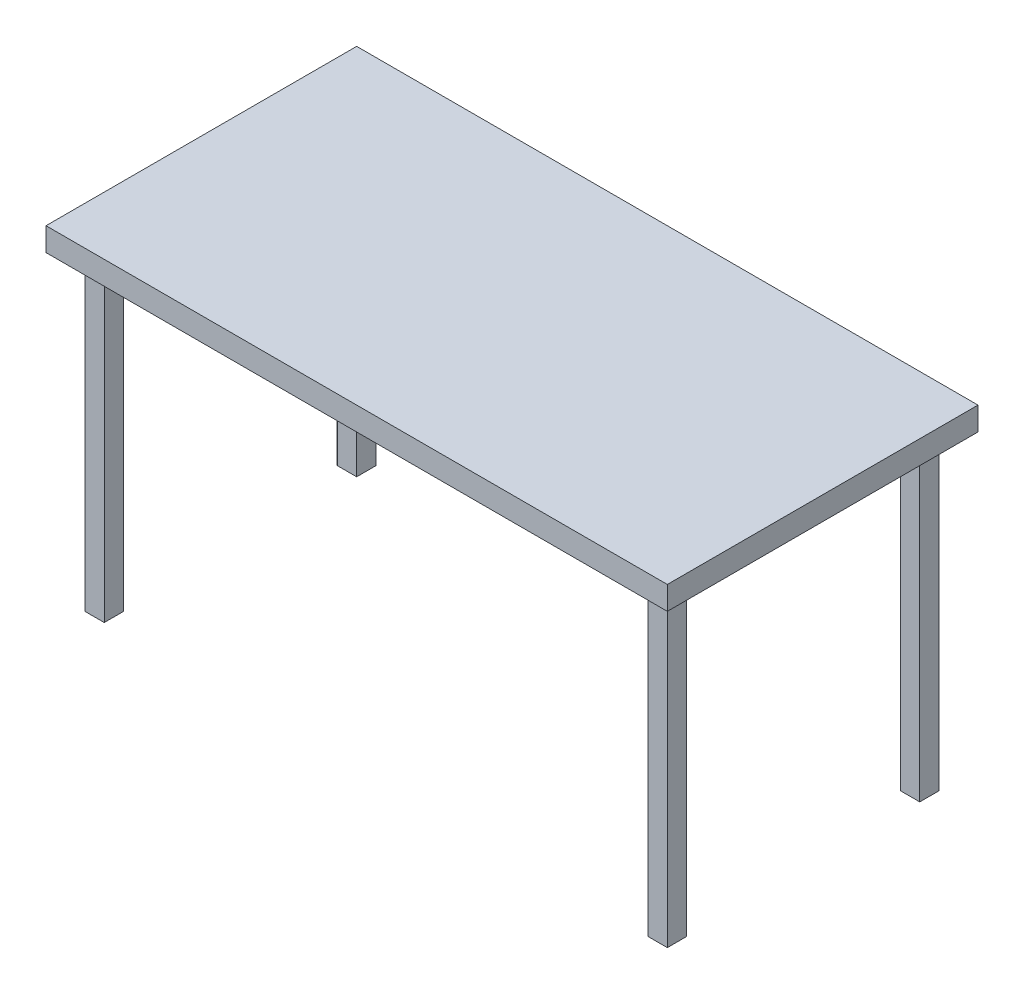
from build123d import *

# Parameters (mm, degrees)
ESQUISSE1_W               = 1600
ESQUISSE1_H               = 800
BOSS_EXTRU_1_DEPTH        = 60
ESQUISSE2_W               = 50
ESQUISSE2_H               = 50
BOSS_EXTRU_2_DEPTH        = 800
SYM_TRIE2_COPY_1_SKETCH_W = 50
SYM_TRIE2_COPY_1_SKETCH_H = 50
SYM_TRIE2_COPY_1_DEPTH    = 800


with BuildPart() as part:
    # Esquisse1 → Boss.-Extru.1 (new body)
    with BuildSketch(Plane(origin=(0, 0, 0), x_dir=(1, 0, 0), z_dir=(0, 1, 0))):
        Rectangle(ESQUISSE1_W, ESQUISSE1_H)
    extrude(amount=BOSS_EXTRU_1_DEPTH)

    # Esquisse2 → Boss.-Extru.2 (add)
    with BuildSketch(Plane.XZ):
        with Locations((-725, 325)):
            Rectangle(ESQUISSE2_W, ESQUISSE2_H)
    boss_extru_2 = extrude(amount=BOSS_EXTRU_2_DEPTH)

    # Sym_trie1: Boss.-Extru.2 across plane
    add(boss_extru_2.mirror(Plane(origin=(0, 0, 0), x_dir=(0, 0, 1), z_dir=(1, 0, 0))))

    # Sym_trie2: Boss.-Extru.2 across plane
    add(boss_extru_2.mirror(Plane.XY))

    # Sym_trie2 copy 1 sketch → Sym_trie2 copy 1 (add)
    with BuildSketch(Plane(origin=(0, 0, 0), x_dir=(-1, 0, 0), z_dir=(0, -1, 0))):
        with Locations((-725, 325)):
            Rectangle(SYM_TRIE2_COPY_1_SKETCH_W, SYM_TRIE2_COPY_1_SKETCH_H)
    extrude(amount=SYM_TRIE2_COPY_1_DEPTH)


solid = part.part
